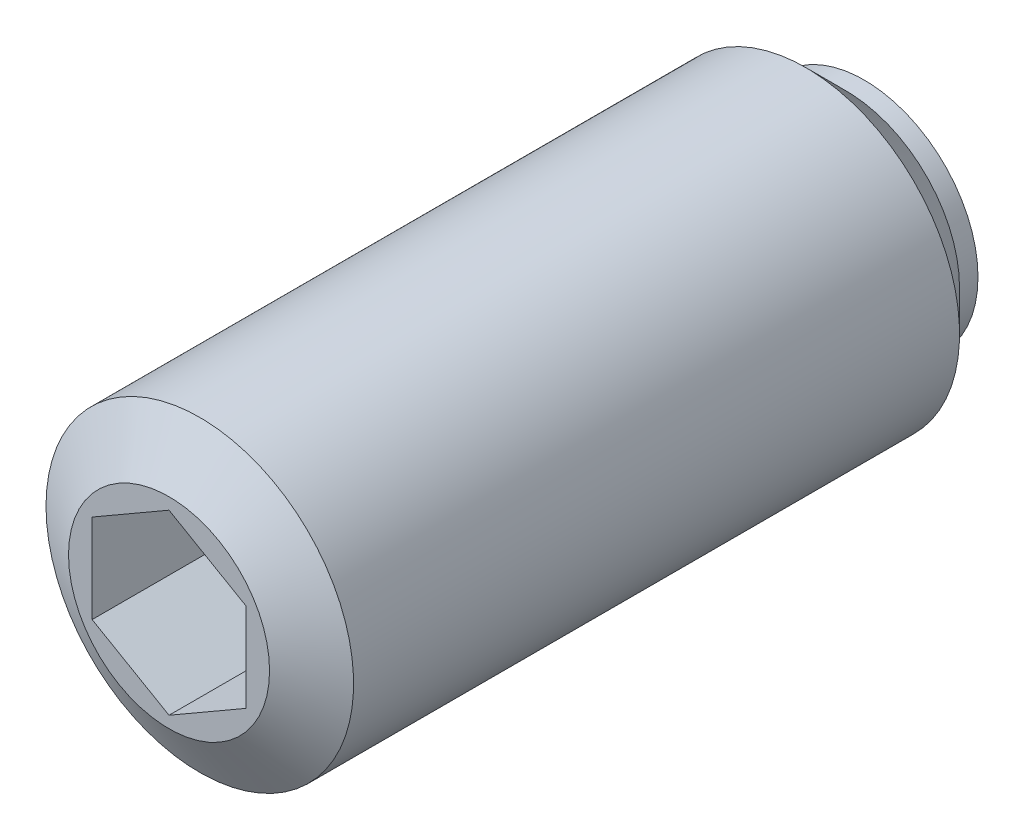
ISO-10303-21;
HEADER;
FILE_DESCRIPTION(('STEP AP214'),'2;1');
FILE_NAME('part.step','',(''),(''),'','','');
FILE_SCHEMA(('AUTOMOTIVE_DESIGN { 1 0 10303 214 1 1 1 1 }'));
ENDSEC;
DATA;
#1=APPLICATION_CONTEXT('core data for automotive mechanical design processes');
#2=APPLICATION_PROTOCOL_DEFINITION('international standard','automotive_design',2000,#1);
#3=PRODUCT_CONTEXT('',#1,'mechanical');
#4=PRODUCT('Part','Part','',(#3));
#5=PRODUCT_RELATED_PRODUCT_CATEGORY('part','',(#4));
#6=PRODUCT_DEFINITION_FORMATION('','',#4);
#7=PRODUCT_DEFINITION_CONTEXT('part definition',#1,'design');
#8=PRODUCT_DEFINITION('design','',#6,#7);
#9=PRODUCT_DEFINITION_SHAPE('','',#8);
#10=(LENGTH_UNIT() NAMED_UNIT(*) SI_UNIT(.MILLI.,.METRE.));
#11=(NAMED_UNIT(*) PLANE_ANGLE_UNIT() SI_UNIT($,.RADIAN.));
#12=(NAMED_UNIT(*) SI_UNIT($,.STERADIAN.) SOLID_ANGLE_UNIT());
#13=UNCERTAINTY_MEASURE_WITH_UNIT(LENGTH_MEASURE(1.E-05),#10,'distance_accuracy_value','');
#14=(GEOMETRIC_REPRESENTATION_CONTEXT(3) GLOBAL_UNCERTAINTY_ASSIGNED_CONTEXT((#13)) GLOBAL_UNIT_ASSIGNED_CONTEXT((#10,
#11,#12)) REPRESENTATION_CONTEXT('',''));
#15=CARTESIAN_POINT('',(0.,0.,0.));
#16=DIRECTION('',(0.,0.,1.));
#17=DIRECTION('',(1.,0.,0.));
#18=AXIS2_PLACEMENT_3D('',#15,#16,#17);
#19=CARTESIAN_POINT('',(0.,0.,1.5));
#20=DIRECTION('',(0.,0.,1.));
#21=DIRECTION('',(0.,-1.,0.));
#22=AXIS2_PLACEMENT_3D('',#19,#20,#21);
#23=SPHERICAL_SURFACE('',#22,1.5);
#24=CARTESIAN_POINT('',(0.,0.,0.7));
#25=DIRECTION('',(0.,0.,1.));
#26=DIRECTION('',(-1.,0.,0.));
#27=AXIS2_PLACEMENT_3D('',#24,#25,#26);
#28=CIRCLE('',#27,1.26885775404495);
#29=CARTESIAN_POINT('',(-1.26885775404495,0.,0.7));
#30=VERTEX_POINT('',#29);
#31=EDGE_CURVE('E9',#30,#30,#28,.T.);
#32=ORIENTED_EDGE('',*,*,#31,.F.);
#33=EDGE_LOOP('',(#32));
#34=FACE_BOUND('',#33,.T.);
#35=ADVANCED_FACE('F14',(#34),#23,.T.);
#36=CARTESIAN_POINT('',(0.,1.85,0.7));
#37=DIRECTION('',(0.,0.,1.));
#38=DIRECTION('',(-1.,0.,0.));
#39=AXIS2_PLACEMENT_3D('',#36,#37,#38);
#40=PLANE('',#39);
#41=CARTESIAN_POINT('',(0.,0.,0.7));
#42=DIRECTION('',(0.,0.,1.));
#43=DIRECTION('',(-1.,0.,0.));
#44=AXIS2_PLACEMENT_3D('',#41,#42,#43);
#45=CIRCLE('',#44,1.85);
#46=CARTESIAN_POINT('',(-1.85,0.,0.7));
#47=VERTEX_POINT('',#46);
#48=EDGE_CURVE('E21',#47,#47,#45,.T.);
#49=ORIENTED_EDGE('',*,*,#48,.F.);
#50=EDGE_LOOP('',(#49));
#51=FACE_BOUND('',#50,.T.);
#52=ORIENTED_EDGE('',*,*,#31,.T.);
#53=EDGE_LOOP('',(#52));
#54=FACE_BOUND('',#53,.T.);
#55=ADVANCED_FACE('F138',(#51,#54),#40,.F.);
#56=CARTESIAN_POINT('',(0.,0.,13.3950749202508));
#57=DIRECTION('',(0.,0.,1.));
#58=DIRECTION('',(-1.,0.,0.));
#59=AXIS2_PLACEMENT_3D('',#56,#57,#58);
#60=CYLINDRICAL_SURFACE('',#59,1.85);
#61=CARTESIAN_POINT('',(0.,0.,1.));
#62=DIRECTION('',(0.,0.,1.));
#63=DIRECTION('',(-1.,0.,0.));
#64=AXIS2_PLACEMENT_3D('',#61,#62,#63);
#65=CIRCLE('',#64,1.85);
#66=CARTESIAN_POINT('',(-1.85,0.,1.));
#67=VERTEX_POINT('',#66);
#68=EDGE_CURVE('E131',#67,#67,#65,.T.);
#69=ORIENTED_EDGE('',*,*,#68,.F.);
#70=EDGE_LOOP('',(#69));
#71=FACE_BOUND('',#70,.T.);
#72=ORIENTED_EDGE('',*,*,#48,.T.);
#73=EDGE_LOOP('',(#72));
#74=FACE_BOUND('',#73,.T.);
#75=ADVANCED_FACE('F136',(#71,#74),#60,.T.);
#76=CARTESIAN_POINT('',(0.,0.,1.));
#77=DIRECTION('',(0.,0.,1.));
#78=DIRECTION('',(-1.,0.,0.));
#79=AXIS2_PLACEMENT_3D('',#76,#77,#78);
#80=CONICAL_SURFACE('',#79,1.85,0.78539816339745);
#81=CARTESIAN_POINT('',(0.,0.,1.65));
#82=DIRECTION('',(0.,0.,1.));
#83=DIRECTION('',(-1.,0.,0.));
#84=AXIS2_PLACEMENT_3D('',#81,#82,#83);
#85=CIRCLE('',#84,2.5);
#86=CARTESIAN_POINT('',(-2.5,0.,1.65));
#87=VERTEX_POINT('',#86);
#88=EDGE_CURVE('E128',#87,#87,#85,.T.);
#89=ORIENTED_EDGE('',*,*,#88,.F.);
#90=EDGE_LOOP('',(#89));
#91=FACE_BOUND('',#90,.T.);
#92=ORIENTED_EDGE('',*,*,#68,.T.);
#93=EDGE_LOOP('',(#92));
#94=FACE_BOUND('',#93,.T.);
#95=ADVANCED_FACE('F161',(#91,#94),#80,.T.);
#96=CARTESIAN_POINT('',(0.,0.,13.3950749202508));
#97=DIRECTION('',(0.,0.,1.));
#98=DIRECTION('',(-1.,0.,0.));
#99=AXIS2_PLACEMENT_3D('',#96,#97,#98);
#100=CYLINDRICAL_SURFACE('',#99,2.5);
#101=CARTESIAN_POINT('',(0.,0.,11.5));
#102=DIRECTION('',(0.,0.,1.));
#103=DIRECTION('',(-1.,0.,0.));
#104=AXIS2_PLACEMENT_3D('',#101,#102,#103);
#105=CIRCLE('',#104,2.5);
#106=CARTESIAN_POINT('',(-2.5,0.,11.5));
#107=VERTEX_POINT('',#106);
#108=EDGE_CURVE('E125',#107,#107,#105,.T.);
#109=ORIENTED_EDGE('',*,*,#108,.F.);
#110=EDGE_LOOP('',(#109));
#111=FACE_BOUND('',#110,.T.);
#112=ORIENTED_EDGE('',*,*,#88,.T.);
#113=EDGE_LOOP('',(#112));
#114=FACE_BOUND('',#113,.T.);
#115=ADVANCED_FACE('F170',(#111,#114),#100,.T.);
#116=CARTESIAN_POINT('',(0.,0.,11.5));
#117=DIRECTION('',(0.,0.,-1.));
#118=DIRECTION('',(1.,0.,0.));
#119=AXIS2_PLACEMENT_3D('',#116,#117,#118);
#120=CONICAL_SURFACE('',#119,2.5,1.04719755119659);
#121=CARTESIAN_POINT('',(0.,0.,12.));
#122=DIRECTION('',(0.,0.,1.));
#123=DIRECTION('',(-1.,0.,0.));
#124=AXIS2_PLACEMENT_3D('',#121,#122,#123);
#125=CIRCLE('',#124,1.63397459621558);
#126=CARTESIAN_POINT('',(-1.63397459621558,0.,12.));
#127=VERTEX_POINT('',#126);
#128=EDGE_CURVE('E116',#127,#127,#125,.T.);
#129=ORIENTED_EDGE('',*,*,#128,.F.);
#130=EDGE_LOOP('',(#129));
#131=FACE_BOUND('',#130,.T.);
#132=ORIENTED_EDGE('',*,*,#108,.T.);
#133=EDGE_LOOP('',(#132));
#134=FACE_BOUND('',#133,.T.);
#135=ADVANCED_FACE('F179',(#131,#134),#120,.T.);
#136=CARTESIAN_POINT('',(0.,0.,12.));
#137=DIRECTION('',(0.,0.,-1.));
#138=DIRECTION('',(1.,0.,0.));
#139=AXIS2_PLACEMENT_3D('',#136,#137,#138);
#140=PLANE('',#139);
#141=DIRECTION('',(-0.866025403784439,-0.5,0.));
#142=VECTOR('',#141,1.);
#143=CARTESIAN_POINT('',(0.,1.44337567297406,12.));
#144=LINE('',#143,#142);
#145=CARTESIAN_POINT('',(0.,1.44337567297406,12.));
#146=VERTEX_POINT('',#145);
#147=CARTESIAN_POINT('',(-1.25,0.721687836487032,12.));
#148=VERTEX_POINT('',#147);
#149=EDGE_CURVE('E82',#146,#148,#144,.T.);
#150=ORIENTED_EDGE('',*,*,#149,.F.);
#151=DIRECTION('',(-0.866025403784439,0.5,0.));
#152=VECTOR('',#151,1.);
#153=CARTESIAN_POINT('',(1.25,0.721687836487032,12.));
#154=LINE('',#153,#152);
#155=CARTESIAN_POINT('',(1.25,0.721687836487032,12.));
#156=VERTEX_POINT('',#155);
#157=EDGE_CURVE('E28',#156,#146,#154,.T.);
#158=ORIENTED_EDGE('',*,*,#157,.F.);
#159=DIRECTION('',(0.,1.,0.));
#160=VECTOR('',#159,1.);
#161=CARTESIAN_POINT('',(1.25,-0.721687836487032,12.));
#162=LINE('',#161,#160);
#163=CARTESIAN_POINT('',(1.25,-0.721687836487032,12.));
#164=VERTEX_POINT('',#163);
#165=EDGE_CURVE('E98',#164,#156,#162,.T.);
#166=ORIENTED_EDGE('',*,*,#165,.F.);
#167=DIRECTION('',(0.866025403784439,0.5,0.));
#168=VECTOR('',#167,1.);
#169=CARTESIAN_POINT('',(0.,-1.44337567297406,12.));
#170=LINE('',#169,#168);
#171=CARTESIAN_POINT('',(0.,-1.44337567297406,12.));
#172=VERTEX_POINT('',#171);
#173=EDGE_CURVE('E92',#172,#164,#170,.T.);
#174=ORIENTED_EDGE('',*,*,#173,.F.);
#175=DIRECTION('',(0.866025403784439,-0.5,0.));
#176=VECTOR('',#175,1.);
#177=CARTESIAN_POINT('',(-1.25,-0.721687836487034,12.));
#178=LINE('',#177,#176);
#179=CARTESIAN_POINT('',(-1.25,-0.721687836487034,12.));
#180=VERTEX_POINT('',#179);
#181=EDGE_CURVE('E90',#180,#172,#178,.T.);
#182=ORIENTED_EDGE('',*,*,#181,.F.);
#183=DIRECTION('',(0.,-1.,0.));
#184=VECTOR('',#183,1.);
#185=CARTESIAN_POINT('',(-1.25,0.721687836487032,12.));
#186=LINE('',#185,#184);
#187=EDGE_CURVE('E71',#148,#180,#186,.T.);
#188=ORIENTED_EDGE('',*,*,#187,.F.);
#189=EDGE_LOOP('',(#150,#158,#166,#174,#182,#188));
#190=FACE_BOUND('',#189,.T.);
#191=ORIENTED_EDGE('',*,*,#128,.T.);
#192=EDGE_LOOP('',(#191));
#193=FACE_BOUND('',#192,.T.);
#194=ADVANCED_FACE('F86',(#190,#193),#140,.F.);
#195=CARTESIAN_POINT('',(1.25,0.721687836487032,9.));
#196=DIRECTION('',(0.5,0.866025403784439,0.));
#197=DIRECTION('',(0.866025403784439,-0.5,0.));
#198=AXIS2_PLACEMENT_3D('',#195,#196,#197);
#199=PLANE('',#198);
#200=ORIENTED_EDGE('',*,*,#157,.T.);
#201=DIRECTION('',(0.,0.,1.));
#202=VECTOR('',#201,1.);
#203=CARTESIAN_POINT('',(0.,1.44337567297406,9.));
#204=LINE('',#203,#202);
#205=CARTESIAN_POINT('',(0.,1.44337567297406,9.));
#206=VERTEX_POINT('',#205);
#207=EDGE_CURVE('E79',#206,#146,#204,.T.);
#208=ORIENTED_EDGE('',*,*,#207,.F.);
#209=DIRECTION('',(-0.866025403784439,0.5,0.));
#210=VECTOR('',#209,1.);
#211=CARTESIAN_POINT('',(1.25,0.721687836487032,9.));
#212=LINE('',#211,#210);
#213=CARTESIAN_POINT('',(1.25,0.721687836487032,9.));
#214=VERTEX_POINT('',#213);
#215=EDGE_CURVE('E100',#214,#206,#212,.T.);
#216=ORIENTED_EDGE('',*,*,#215,.F.);
#217=DIRECTION('',(0.,0.,1.));
#218=VECTOR('',#217,1.);
#219=CARTESIAN_POINT('',(1.25,0.721687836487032,9.));
#220=LINE('',#219,#218);
#221=EDGE_CURVE('E35',#214,#156,#220,.T.);
#222=ORIENTED_EDGE('',*,*,#221,.T.);
#223=EDGE_LOOP('',(#200,#208,#216,#222));
#224=FACE_BOUND('',#223,.T.);
#225=ADVANCED_FACE('F196',(#224),#199,.F.);
#226=CARTESIAN_POINT('',(1.25,-0.721687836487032,9.));
#227=DIRECTION('',(1.,0.,0.));
#228=DIRECTION('',(0.,-1.,0.));
#229=AXIS2_PLACEMENT_3D('',#226,#227,#228);
#230=PLANE('',#229);
#231=ORIENTED_EDGE('',*,*,#165,.T.);
#232=ORIENTED_EDGE('',*,*,#221,.F.);
#233=DIRECTION('',(0.,1.,0.));
#234=VECTOR('',#233,1.);
#235=CARTESIAN_POINT('',(1.25,-0.721687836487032,9.));
#236=LINE('',#235,#234);
#237=CARTESIAN_POINT('',(1.25,-0.721687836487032,9.));
#238=VERTEX_POINT('',#237);
#239=EDGE_CURVE('E112',#238,#214,#236,.T.);
#240=ORIENTED_EDGE('',*,*,#239,.F.);
#241=DIRECTION('',(0.,0.,1.));
#242=VECTOR('',#241,1.);
#243=CARTESIAN_POINT('',(1.25,-0.721687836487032,9.));
#244=LINE('',#243,#242);
#245=EDGE_CURVE('E117',#238,#164,#244,.T.);
#246=ORIENTED_EDGE('',*,*,#245,.T.);
#247=EDGE_LOOP('',(#231,#232,#240,#246));
#248=FACE_BOUND('',#247,.T.);
#249=ADVANCED_FACE('F204',(#248),#230,.F.);
#250=CARTESIAN_POINT('',(0.,-1.44337567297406,9.));
#251=DIRECTION('',(0.5,-0.866025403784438,0.));
#252=DIRECTION('',(-0.866025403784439,-0.5,0.));
#253=AXIS2_PLACEMENT_3D('',#250,#251,#252);
#254=PLANE('',#253);
#255=ORIENTED_EDGE('',*,*,#173,.T.);
#256=ORIENTED_EDGE('',*,*,#245,.F.);
#257=DIRECTION('',(0.866025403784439,0.5,0.));
#258=VECTOR('',#257,1.);
#259=CARTESIAN_POINT('',(0.,-1.44337567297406,9.));
#260=LINE('',#259,#258);
#261=CARTESIAN_POINT('',(0.,-1.44337567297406,9.));
#262=VERTEX_POINT('',#261);
#263=EDGE_CURVE('E109',#262,#238,#260,.T.);
#264=ORIENTED_EDGE('',*,*,#263,.F.);
#265=DIRECTION('',(0.,0.,1.));
#266=VECTOR('',#265,1.);
#267=CARTESIAN_POINT('',(0.,-1.44337567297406,9.));
#268=LINE('',#267,#266);
#269=EDGE_CURVE('E119',#262,#172,#268,.T.);
#270=ORIENTED_EDGE('',*,*,#269,.T.);
#271=EDGE_LOOP('',(#255,#256,#264,#270));
#272=FACE_BOUND('',#271,.T.);
#273=ADVANCED_FACE('F212',(#272),#254,.F.);
#274=CARTESIAN_POINT('',(-1.25,-0.721687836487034,9.));
#275=DIRECTION('',(-0.5,-0.866025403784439,0.));
#276=DIRECTION('',(-0.866025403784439,0.5,0.));
#277=AXIS2_PLACEMENT_3D('',#274,#275,#276);
#278=PLANE('',#277);
#279=ORIENTED_EDGE('',*,*,#181,.T.);
#280=ORIENTED_EDGE('',*,*,#269,.F.);
#281=DIRECTION('',(0.866025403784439,-0.5,0.));
#282=VECTOR('',#281,1.);
#283=CARTESIAN_POINT('',(-1.25,-0.721687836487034,9.));
#284=LINE('',#283,#282);
#285=CARTESIAN_POINT('',(-1.25,-0.721687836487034,9.));
#286=VERTEX_POINT('',#285);
#287=EDGE_CURVE('E106',#286,#262,#284,.T.);
#288=ORIENTED_EDGE('',*,*,#287,.F.);
#289=DIRECTION('',(0.,0.,1.));
#290=VECTOR('',#289,1.);
#291=CARTESIAN_POINT('',(-1.25,-0.721687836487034,9.));
#292=LINE('',#291,#290);
#293=EDGE_CURVE('E78',#286,#180,#292,.T.);
#294=ORIENTED_EDGE('',*,*,#293,.T.);
#295=EDGE_LOOP('',(#279,#280,#288,#294));
#296=FACE_BOUND('',#295,.T.);
#297=ADVANCED_FACE('F220',(#296),#278,.F.);
#298=CARTESIAN_POINT('',(-1.25,0.721687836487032,9.));
#299=DIRECTION('',(-1.,0.,0.));
#300=DIRECTION('',(0.,1.,0.));
#301=AXIS2_PLACEMENT_3D('',#298,#299,#300);
#302=PLANE('',#301);
#303=ORIENTED_EDGE('',*,*,#187,.T.);
#304=ORIENTED_EDGE('',*,*,#293,.F.);
#305=DIRECTION('',(0.,-1.,0.));
#306=VECTOR('',#305,1.);
#307=CARTESIAN_POINT('',(-1.25,0.721687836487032,9.));
#308=LINE('',#307,#306);
#309=CARTESIAN_POINT('',(-1.25,0.721687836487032,9.));
#310=VERTEX_POINT('',#309);
#311=EDGE_CURVE('E74',#310,#286,#308,.T.);
#312=ORIENTED_EDGE('',*,*,#311,.F.);
#313=DIRECTION('',(0.,0.,1.));
#314=VECTOR('',#313,1.);
#315=CARTESIAN_POINT('',(-1.25,0.721687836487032,9.));
#316=LINE('',#315,#314);
#317=EDGE_CURVE('E67',#310,#148,#316,.T.);
#318=ORIENTED_EDGE('',*,*,#317,.T.);
#319=EDGE_LOOP('',(#303,#304,#312,#318));
#320=FACE_BOUND('',#319,.T.);
#321=ADVANCED_FACE('F69',(#320),#302,.F.);
#322=CARTESIAN_POINT('',(0.,1.44337567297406,9.));
#323=DIRECTION('',(-0.5,0.866025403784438,0.));
#324=DIRECTION('',(0.866025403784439,0.5,0.));
#325=AXIS2_PLACEMENT_3D('',#322,#323,#324);
#326=PLANE('',#325);
#327=ORIENTED_EDGE('',*,*,#149,.T.);
#328=ORIENTED_EDGE('',*,*,#317,.F.);
#329=DIRECTION('',(-0.866025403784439,-0.5,0.));
#330=VECTOR('',#329,1.);
#331=CARTESIAN_POINT('',(0.,1.44337567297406,9.));
#332=LINE('',#331,#330);
#333=EDGE_CURVE('E103',#206,#310,#332,.T.);
#334=ORIENTED_EDGE('',*,*,#333,.F.);
#335=ORIENTED_EDGE('',*,*,#207,.T.);
#336=EDGE_LOOP('',(#327,#328,#334,#335));
#337=FACE_BOUND('',#336,.T.);
#338=ADVANCED_FACE('F83',(#337),#326,.F.);
#339=CARTESIAN_POINT('',(2.5,0.,9.));
#340=DIRECTION('',(0.,0.,-1.));
#341=DIRECTION('',(1.,0.,0.));
#342=AXIS2_PLACEMENT_3D('',#339,#340,#341);
#343=PLANE('',#342);
#344=ORIENTED_EDGE('',*,*,#215,.T.);
#345=ORIENTED_EDGE('',*,*,#333,.T.);
#346=ORIENTED_EDGE('',*,*,#311,.T.);
#347=ORIENTED_EDGE('',*,*,#287,.T.);
#348=ORIENTED_EDGE('',*,*,#263,.T.);
#349=ORIENTED_EDGE('',*,*,#239,.T.);
#350=EDGE_LOOP('',(#344,#345,#346,#347,#348,#349));
#351=FACE_BOUND('',#350,.T.);
#352=ADVANCED_FACE('F244',(#351),#343,.F.);
#353=CLOSED_SHELL('',(#35,#55,#75,#95,#115,#135,#194,#225,#249,#273,#297,#321,#338,#352));
#354=MANIFOLD_SOLID_BREP('B1',#353);
#355=ADVANCED_BREP_SHAPE_REPRESENTATION('',(#18,#354),#14);
#356=SHAPE_DEFINITION_REPRESENTATION(#9,#355);
ENDSEC;
END-ISO-10303-21;
